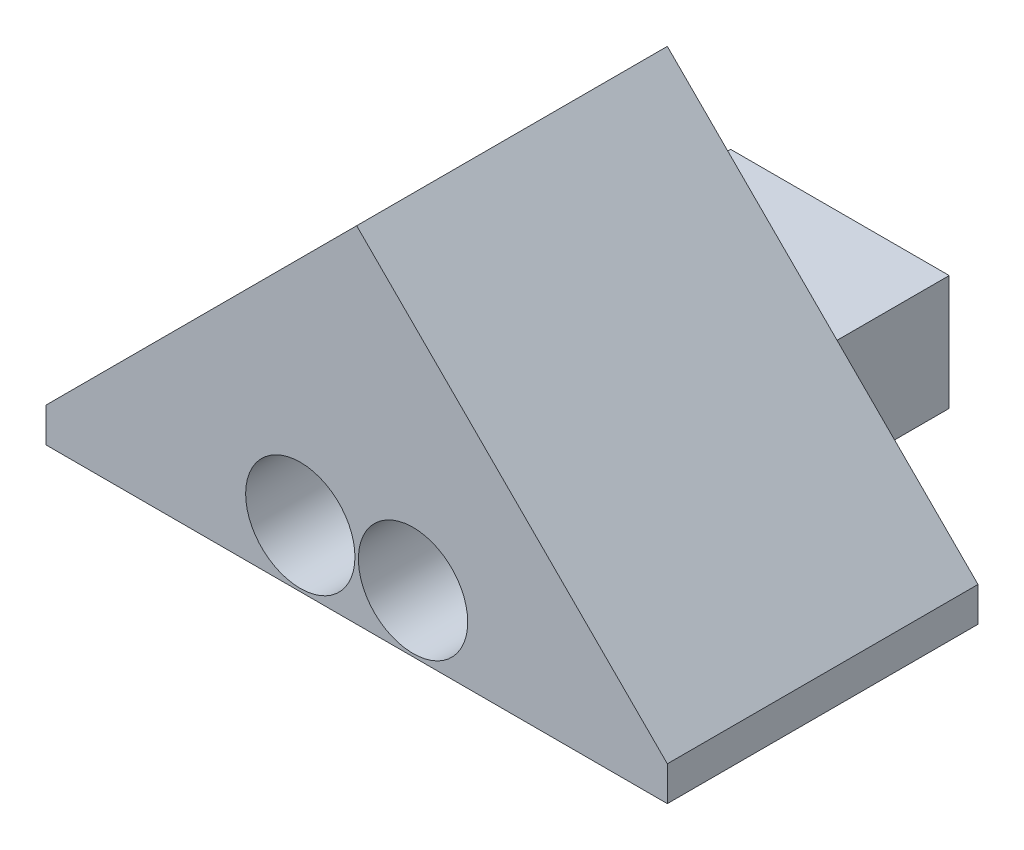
from build123d import *

# Parameters (mm, degrees)
ESQUISSE1_W              = 54
ESQUISSE1_H              = 30
BOSS_EXTRU_1_DEPTH       = 27
ENL_V_MAT_EXTRU_1_DEPTH  = 27
ENL_V_MAT_EXTRU_2_DEPTH  = 27
ESQUISSE4_W              = 19
ESQUISSE4_H              = 10
ESQUISSE4_R              = 2
BOSS_EXTRU_2_DEPTH       = 15
ESQUISSE5_R              = 4.75
ENL_V_MAT_EXTRU_20_DEPTH = 36


with BuildPart() as part:
    # Esquisse1 → Boss.-Extru.1 (new body)
    with BuildSketch(Plane.XY):
        with Locations((5.452380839, 7.832727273)):
            Rectangle(ESQUISSE1_W, ESQUISSE1_H)
    extrude(amount=BOSS_EXTRU_1_DEPTH)

    # Esquisse2 → Enl_v. mat.-Extru.1 (cut)
    with BuildSketch(Plane.XY.offset(27)):
        Polygon((-21.547619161, -4.167272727), (5.452380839, 22.832727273), (-21.547619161, 22.832727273), align=None)
    extrude(amount=-ENL_V_MAT_EXTRU_1_DEPTH, mode=Mode.SUBTRACT)

    # Esquisse3 → Enl_v. mat.-Extru.2 (cut)
    with BuildSketch(Plane.XY.offset(27)):
        Polygon((5.452380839, 22.832727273), (32.452380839, -4.167272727), (32.452380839, 22.832727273), align=None)
    extrude(amount=-ENL_V_MAT_EXTRU_2_DEPTH, mode=Mode.SUBTRACT)

    # Esquisse4 → Boss.-Extru.2 (add)
    with BuildSketch(Plane(origin=(0, 0, 0), x_dir=(-1, 0, 0), z_dir=(0, 0, -1))):
        with Locations((-5.452380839, -2.167272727)):
            Rectangle(ESQUISSE4_W, ESQUISSE4_H)
        with Locations((-10.352380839, -2.167272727)):
            Circle(ESQUISSE4_R, mode=Mode.SUBTRACT)
        with Locations((-0.552380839, -2.167272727)):
            Circle(ESQUISSE4_R, mode=Mode.SUBTRACT)
    extrude(amount=BOSS_EXTRU_2_DEPTH)

    # Esquisse5 → Enl_v. mat.-Extru.20 (cut)
    with BuildSketch(Plane(origin=(0, 0, 0), x_dir=(-1, 0, 0), z_dir=(0, 0, -1))):
        with Locations(Location((-0.552380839, -2.167272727, 0), (0, 0, 14.437300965))):
            Circle(ESQUISSE5_R)
        with Locations(Location((-10.352380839, -2.167272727, 0), (0, 0, 194.437300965))):
            Circle(ESQUISSE5_R)
    extrude(amount=-ENL_V_MAT_EXTRU_20_DEPTH, mode=Mode.SUBTRACT)


solid = part.part
